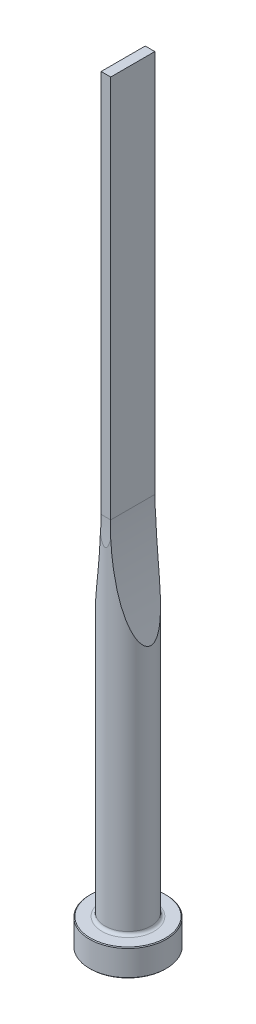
from build123d import *

# Parameters (mm, degrees)
CUT_EXTRUDE1_DEPTH = 7.5
CUT_EXTRUDE2_DEPTH = 7.5


with BuildPart() as part:
    # Sketch1 → Revolve1 (revolve)
    with BuildSketch(Plane.XY, mode=Mode.PRIVATE) as revolve1_sk:
        with BuildLine():
            Line((0, 0), (9.8, 0))
            Line((9.8, 0), (10, 0.2))
            Line((10, 0.2), (10, 6.8))
            Line((10, 6.8), (9.8, 7))
            Line((9.8, 7), (6.8, 7))
            ThreePointArc((6.8, 7), (6.234314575, 7.234314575), (6, 7.8))
            Line((6, 7.8), (6, 200))
            Line((6, 200), (0, 200))
            Line((0, 200), (0, 0))
        make_face()
    revolve(revolve1_sk.sketch.rotate(Axis((0, 200, 0), (0, -1, 0)), 180), axis=Axis((0, 200, 0), (0, -1, 0)))

    # Sketch2 → Cut-Extrude1 (cut, symmetric)
    with BuildSketch(Plane.XY):
        with BuildLine():
            Line((1.25, 200), (1.25, 100))
            ThreePointArc((1.25, 100), (2.445439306, 85.379808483), (6, 71.148007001))
            Line((6, 71.148007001), (6, 200))
            Line((6, 200), (1.25, 200))
        make_face()
        with BuildLine():
            Line((-1.25, 200), (-1.25, 100))
            ThreePointArc((-1.25, 100), (-2.445439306, 85.379808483), (-6, 71.148007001))
            Line((-6, 71.148007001), (-6, 200))
            Line((-6, 200), (-1.25, 200))
        make_face()
    extrude(amount=CUT_EXTRUDE1_DEPTH, both=True, mode=Mode.SUBTRACT)

    # Sketch3 → Cut-Extrude2 (cut, symmetric)
    with BuildSketch(Plane(origin=(0, 0, 0), x_dir=(0, 0, -1), z_dir=(1, 0, 0))):
        with BuildLine():
            Line((5.75, 200), (5.75, 100))
            ThreePointArc((5.75, 100), (5.812521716, 96.645898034), (6, 93.296456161))
            Line((6, 93.296456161), (6, 200))
            Line((6, 200), (5.75, 200))
        make_face()
        with BuildLine():
            Line((-5.75, 200), (-5.75, 100))
            ThreePointArc((-5.75, 100), (-5.812521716, 96.645898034), (-6, 93.296456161))
            Line((-6, 93.296456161), (-6, 200))
            Line((-6, 200), (-5.75, 200))
        make_face()
    extrude(amount=CUT_EXTRUDE2_DEPTH, both=True, mode=Mode.SUBTRACT)


solid = part.part
